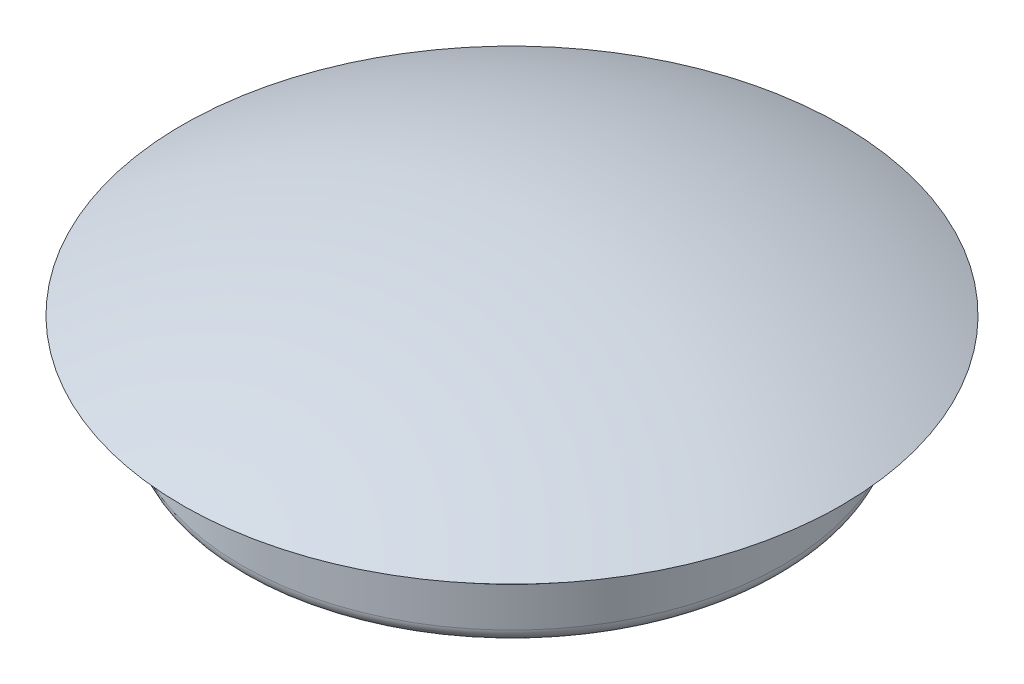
ISO-10303-21;
HEADER;
FILE_DESCRIPTION(('STEP AP214'),'2;1');
FILE_NAME('part.step','',(''),(''),'','','');
FILE_SCHEMA(('AUTOMOTIVE_DESIGN { 1 0 10303 214 1 1 1 1 }'));
ENDSEC;
DATA;
#1=APPLICATION_CONTEXT('core data for automotive mechanical design processes');
#2=APPLICATION_PROTOCOL_DEFINITION('international standard','automotive_design',2000,#1);
#3=PRODUCT_CONTEXT('',#1,'mechanical');
#4=PRODUCT('Part','Part','',(#3));
#5=PRODUCT_RELATED_PRODUCT_CATEGORY('part','',(#4));
#6=PRODUCT_DEFINITION_FORMATION('','',#4);
#7=PRODUCT_DEFINITION_CONTEXT('part definition',#1,'design');
#8=PRODUCT_DEFINITION('design','',#6,#7);
#9=PRODUCT_DEFINITION_SHAPE('','',#8);
#10=(LENGTH_UNIT() NAMED_UNIT(*) SI_UNIT(.MILLI.,.METRE.));
#11=(NAMED_UNIT(*) PLANE_ANGLE_UNIT() SI_UNIT($,.RADIAN.));
#12=(NAMED_UNIT(*) SI_UNIT($,.STERADIAN.) SOLID_ANGLE_UNIT());
#13=UNCERTAINTY_MEASURE_WITH_UNIT(LENGTH_MEASURE(1.E-05),#10,'distance_accuracy_value','');
#14=(GEOMETRIC_REPRESENTATION_CONTEXT(3) GLOBAL_UNCERTAINTY_ASSIGNED_CONTEXT((#13)) GLOBAL_UNIT_ASSIGNED_CONTEXT((#10,
#11,#12)) REPRESENTATION_CONTEXT('',''));
#15=CARTESIAN_POINT('',(0.,0.,0.));
#16=DIRECTION('',(0.,0.,1.));
#17=DIRECTION('',(1.,0.,0.));
#18=AXIS2_PLACEMENT_3D('',#15,#16,#17);
#19=CARTESIAN_POINT('',(6.5,4.,0.));
#20=DIRECTION('',(0.,-1.,0.));
#21=DIRECTION('',(0.,0.,-1.));
#22=AXIS2_PLACEMENT_3D('',#19,#20,#21);
#23=PLANE('',#22);
#24=CARTESIAN_POINT('',(0.,4.,0.));
#25=DIRECTION('',(0.,1.,0.));
#26=DIRECTION('',(0.,0.,1.));
#27=AXIS2_PLACEMENT_3D('',#24,#25,#26);
#28=CIRCLE('',#27,6.5);
#29=CARTESIAN_POINT('',(0.,4.,-6.5));
#30=VERTEX_POINT('',#29);
#31=CARTESIAN_POINT('',(0.,4.,6.5));
#32=VERTEX_POINT('',#31);
#33=EDGE_CURVE('E48',#30,#32,#28,.F.);
#34=ORIENTED_EDGE('',*,*,#33,.T.);
#35=CARTESIAN_POINT('',(0.,4.,0.));
#36=DIRECTION('',(0.,1.,0.));
#37=DIRECTION('',(0.,0.,-1.));
#38=AXIS2_PLACEMENT_3D('',#35,#36,#37);
#39=CIRCLE('',#38,6.5);
#40=EDGE_CURVE('E45',#32,#30,#39,.F.);
#41=ORIENTED_EDGE('',*,*,#40,.T.);
#42=EDGE_LOOP('',(#34,#41));
#43=FACE_BOUND('',#42,.T.);
#44=ADVANCED_FACE('F17',(#43),#23,.T.);
#45=CARTESIAN_POINT('',(0.,3.,0.));
#46=DIRECTION('',(0.,1.,0.));
#47=DIRECTION('',(0.,0.,1.));
#48=AXIS2_PLACEMENT_3D('',#45,#46,#47);
#49=TOROIDAL_SURFACE('',#48,6.5,1.);
#50=CARTESIAN_POINT('',(0.,3.,0.));
#51=DIRECTION('',(0.,1.,0.));
#52=DIRECTION('',(0.,0.,1.));
#53=AXIS2_PLACEMENT_3D('',#50,#51,#52);
#54=CIRCLE('',#53,7.5);
#55=CARTESIAN_POINT('',(0.,3.,7.5));
#56=VERTEX_POINT('',#55);
#57=EDGE_CURVE('E52',#56,#56,#54,.F.);
#58=ORIENTED_EDGE('',*,*,#57,.T.);
#59=EDGE_LOOP('',(#58));
#60=FACE_BOUND('',#59,.T.);
#61=ORIENTED_EDGE('',*,*,#40,.F.);
#62=ORIENTED_EDGE('',*,*,#33,.F.);
#63=EDGE_LOOP('',(#61,#62));
#64=FACE_BOUND('',#63,.T.);
#65=ADVANCED_FACE('F55',(#60,#64),#49,.F.);
#66=CARTESIAN_POINT('',(0.,7.39629683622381,0.));
#67=DIRECTION('',(0.,1.,0.));
#68=DIRECTION('',(0.,0.,1.));
#69=AXIS2_PLACEMENT_3D('',#66,#67,#68);
#70=CYLINDRICAL_SURFACE('',#69,7.5);
#71=CARTESIAN_POINT('',(0.,0.,0.));
#72=DIRECTION('',(0.,1.,0.));
#73=DIRECTION('',(0.,0.,1.));
#74=AXIS2_PLACEMENT_3D('',#71,#72,#73);
#75=CIRCLE('',#74,7.5);
#76=CARTESIAN_POINT('',(0.,0.,7.5));
#77=VERTEX_POINT('',#76);
#78=EDGE_CURVE('E114',#77,#77,#75,.F.);
#79=ORIENTED_EDGE('',*,*,#78,.T.);
#80=EDGE_LOOP('',(#79));
#81=FACE_BOUND('',#80,.T.);
#82=ORIENTED_EDGE('',*,*,#57,.F.);
#83=EDGE_LOOP('',(#82));
#84=FACE_BOUND('',#83,.T.);
#85=ADVANCED_FACE('F118',(#81,#84),#70,.F.);
#86=CARTESIAN_POINT('',(0.,0.,0.));
#87=DIRECTION('',(0.,1.,0.));
#88=DIRECTION('',(0.,0.,1.));
#89=AXIS2_PLACEMENT_3D('',#86,#87,#88);
#90=PLANE('',#89);
#91=ORIENTED_EDGE('',*,*,#78,.F.);
#92=EDGE_LOOP('',(#91));
#93=FACE_BOUND('',#92,.T.);
#94=CARTESIAN_POINT('',(0.,0.,0.));
#95=DIRECTION('',(0.,1.,0.));
#96=DIRECTION('',(0.,0.,1.));
#97=AXIS2_PLACEMENT_3D('',#94,#95,#96);
#98=CIRCLE('',#97,9.75);
#99=CARTESIAN_POINT('',(0.,0.,9.75));
#100=VERTEX_POINT('',#99);
#101=CARTESIAN_POINT('',(0.,0.,-9.75));
#102=VERTEX_POINT('',#101);
#103=EDGE_CURVE('E87',#100,#102,#98,.T.);
#104=ORIENTED_EDGE('',*,*,#103,.F.);
#105=CARTESIAN_POINT('',(0.,0.,0.));
#106=DIRECTION('',(0.,1.,0.));
#107=DIRECTION('',(0.,0.,-1.));
#108=AXIS2_PLACEMENT_3D('',#105,#106,#107);
#109=CIRCLE('',#108,9.75);
#110=EDGE_CURVE('E36',#102,#100,#109,.T.);
#111=ORIENTED_EDGE('',*,*,#110,.F.);
#112=EDGE_LOOP('',(#104,#111));
#113=FACE_BOUND('',#112,.T.);
#114=ADVANCED_FACE('F74',(#93,#113),#90,.F.);
#115=CARTESIAN_POINT('',(0.,0.5,0.));
#116=DIRECTION('',(0.,1.,0.));
#117=DIRECTION('',(0.,0.,1.));
#118=AXIS2_PLACEMENT_3D('',#115,#116,#117);
#119=TOROIDAL_SURFACE('',#118,9.75,0.5);
#120=CARTESIAN_POINT('',(0.,0.5,0.));
#121=DIRECTION('',(0.,1.,0.));
#122=DIRECTION('',(0.,0.,1.));
#123=AXIS2_PLACEMENT_3D('',#120,#121,#122);
#124=CIRCLE('',#123,10.25);
#125=CARTESIAN_POINT('',(0.,0.5,10.25));
#126=VERTEX_POINT('',#125);
#127=EDGE_CURVE('E84',#126,#126,#124,.T.);
#128=ORIENTED_EDGE('',*,*,#127,.F.);
#129=EDGE_LOOP('',(#128));
#130=FACE_BOUND('',#129,.T.);
#131=ORIENTED_EDGE('',*,*,#103,.T.);
#132=ORIENTED_EDGE('',*,*,#110,.T.);
#133=EDGE_LOOP('',(#131,#132));
#134=FACE_BOUND('',#133,.T.);
#135=ADVANCED_FACE('F62',(#130,#134),#119,.T.);
#136=CARTESIAN_POINT('',(0.,16.8559800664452,0.));
#137=DIRECTION('',(0.,1.,0.));
#138=DIRECTION('',(0.,0.,1.));
#139=AXIS2_PLACEMENT_3D('',#136,#137,#138);
#140=CYLINDRICAL_SURFACE('',#139,10.25);
#141=CARTESIAN_POINT('',(0.,2.,0.));
#142=DIRECTION('',(0.,1.,0.));
#143=DIRECTION('',(0.,0.,1.));
#144=AXIS2_PLACEMENT_3D('',#141,#142,#143);
#145=CIRCLE('',#144,10.25);
#146=CARTESIAN_POINT('',(0.,2.,10.25));
#147=VERTEX_POINT('',#146);
#148=EDGE_CURVE('E162',#147,#147,#145,.F.);
#149=ORIENTED_EDGE('',*,*,#148,.T.);
#150=EDGE_LOOP('',(#149));
#151=FACE_BOUND('',#150,.T.);
#152=ORIENTED_EDGE('',*,*,#127,.T.);
#153=EDGE_LOOP('',(#152));
#154=FACE_BOUND('',#153,.T.);
#155=ADVANCED_FACE('F73',(#151,#154),#140,.T.);
#156=CARTESIAN_POINT('',(10.25,2.,0.));
#157=DIRECTION('',(0.,-1.,0.));
#158=DIRECTION('',(0.,0.,-1.));
#159=AXIS2_PLACEMENT_3D('',#156,#157,#158);
#160=PLANE('',#159);
#161=ORIENTED_EDGE('',*,*,#148,.F.);
#162=EDGE_LOOP('',(#161));
#163=FACE_BOUND('',#162,.T.);
#164=CARTESIAN_POINT('',(0.,2.,0.));
#165=DIRECTION('',(0.,1.,0.));
#166=DIRECTION('',(0.,0.,1.));
#167=AXIS2_PLACEMENT_3D('',#164,#165,#166);
#168=CIRCLE('',#167,9.);
#169=CARTESIAN_POINT('',(0.,2.,9.));
#170=VERTEX_POINT('',#169);
#171=EDGE_CURVE('E160',#170,#170,#168,.T.);
#172=ORIENTED_EDGE('',*,*,#171,.F.);
#173=EDGE_LOOP('',(#172));
#174=FACE_BOUND('',#173,.T.);
#175=ADVANCED_FACE('F156',(#163,#174),#160,.F.);
#176=CARTESIAN_POINT('',(0.,16.8559800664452,0.));
#177=DIRECTION('',(0.,1.,0.));
#178=DIRECTION('',(0.,0.,1.));
#179=AXIS2_PLACEMENT_3D('',#176,#177,#178);
#180=CYLINDRICAL_SURFACE('',#179,9.);
#181=CARTESIAN_POINT('',(0.,3.6,0.));
#182=DIRECTION('',(0.,1.,0.));
#183=DIRECTION('',(0.,0.,1.));
#184=AXIS2_PLACEMENT_3D('',#181,#182,#183);
#185=CIRCLE('',#184,9.);
#186=CARTESIAN_POINT('',(0.,3.6,9.));
#187=VERTEX_POINT('',#186);
#188=EDGE_CURVE('E28',#187,#187,#185,.F.);
#189=ORIENTED_EDGE('',*,*,#188,.T.);
#190=EDGE_LOOP('',(#189));
#191=FACE_BOUND('',#190,.T.);
#192=ORIENTED_EDGE('',*,*,#171,.T.);
#193=EDGE_LOOP('',(#192));
#194=FACE_BOUND('',#193,.T.);
#195=ADVANCED_FACE('F149',(#191,#194),#180,.T.);
#196=CARTESIAN_POINT('',(9.,3.6,0.));
#197=DIRECTION('',(0.,1.,0.));
#198=DIRECTION('',(0.,0.,1.));
#199=AXIS2_PLACEMENT_3D('',#196,#197,#198);
#200=PLANE('',#199);
#201=ORIENTED_EDGE('',*,*,#188,.F.);
#202=EDGE_LOOP('',(#201));
#203=FACE_BOUND('',#202,.T.);
#204=CARTESIAN_POINT('',(12.5,3.6,0.));
#205=CARTESIAN_POINT('',(12.4999980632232,3.6,-0.350925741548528));
#206=CARTESIAN_POINT('',(12.4852097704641,3.6,-0.701915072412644));
#207=CARTESIAN_POINT('',(12.4261423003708,3.6,-1.40154352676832));
#208=CARTESIAN_POINT('',(12.3818485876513,3.6,-1.75018140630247));
#209=CARTESIAN_POINT('',(12.2639605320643,3.6,-2.44315774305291));
#210=CARTESIAN_POINT('',(12.1903107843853,3.6,-2.78748679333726));
#211=CARTESIAN_POINT('',(12.0142351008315,3.6,-3.46870681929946));
#212=CARTESIAN_POINT('',(11.9118089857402,3.60000000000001,-3.80559774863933));
#213=CARTESIAN_POINT('',(11.6790100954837,3.60000000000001,-4.46925905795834));
#214=CARTESIAN_POINT('',(11.5486612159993,3.6,-4.79603781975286));
#215=CARTESIAN_POINT('',(11.2608879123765,3.6,-5.43745955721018));
#216=CARTESIAN_POINT('',(11.1034626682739,3.6,-5.75210216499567));
#217=CARTESIAN_POINT('',(10.7627419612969,3.6,-6.36685385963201));
#218=CARTESIAN_POINT('',(10.5794590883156,3.6,-6.66696992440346));
#219=CARTESIAN_POINT('',(10.1882694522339,3.6,-7.25069695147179));
#220=CARTESIAN_POINT('',(9.98036287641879,3.6,-7.53430803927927));
#221=CARTESIAN_POINT('',(9.54135888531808,3.6,-8.08306624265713));
#222=CARTESIAN_POINT('',(9.310256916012,3.6,-8.34820971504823));
#223=CARTESIAN_POINT('',(8.82653862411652,3.6,-8.85808702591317));
#224=CARTESIAN_POINT('',(8.57392225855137,3.6,-9.10282082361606));
#225=CARTESIAN_POINT('',(8.04894889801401,3.6,-9.57015843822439));
#226=CARTESIAN_POINT('',(7.77659021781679,3.6,-9.792760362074));
#227=CARTESIAN_POINT('',(7.21408789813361,3.6,-10.2142276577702));
#228=CARTESIAN_POINT('',(6.92394426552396,3.59999999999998,-10.4130930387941));
#229=CARTESIAN_POINT('',(6.32794608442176,3.59999999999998,-10.7856664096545));
#230=CARTESIAN_POINT('',(6.02209212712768,3.6,-10.9593753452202));
#231=CARTESIAN_POINT('',(5.39683771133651,3.6,-11.2804097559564));
#232=CARTESIAN_POINT('',(5.07743725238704,3.6,-11.4277352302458));
#233=CARTESIAN_POINT('',(4.42736410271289,3.6,-11.6949538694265));
#234=CARTESIAN_POINT('',(4.09669153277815,3.6,-11.8148473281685));
#235=CARTESIAN_POINT('',(3.4264217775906,3.6,-12.0263515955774));
#236=CARTESIAN_POINT('',(3.08682459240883,3.60000000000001,-12.1179624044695));
#237=CARTESIAN_POINT('',(2.4011180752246,3.60000000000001,-12.2722504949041));
#238=CARTESIAN_POINT('',(2.05500870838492,3.6,-12.3349276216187));
#239=CARTESIAN_POINT('',(1.35874022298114,3.6,-12.4309020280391));
#240=CARTESIAN_POINT('',(1.00858110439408,3.6,-12.4641993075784));
#241=CARTESIAN_POINT('',(0.306702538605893,3.6,-12.5011772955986));
#242=CARTESIAN_POINT('',(-0.0450169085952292,3.6,-12.5048580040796));
#243=CARTESIAN_POINT('',(-0.747515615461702,3.6,-12.4825766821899));
#244=CARTESIAN_POINT('',(-1.09829487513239,3.6,-12.4566146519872));
#245=CARTESIAN_POINT('',(-1.79641750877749,3.6,-12.3752326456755));
#246=CARTESIAN_POINT('',(-2.14376090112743,3.6,-12.3198128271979));
#247=CARTESIAN_POINT('',(-2.8325443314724,3.6,-12.179909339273));
#248=CARTESIAN_POINT('',(-3.17398436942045,3.6,-12.0954256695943));
#249=CARTESIAN_POINT('',(-3.84853729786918,3.6,-11.8979940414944));
#250=CARTESIAN_POINT('',(-4.18165009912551,3.6,-11.7850457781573));
#251=CARTESIAN_POINT('',(-4.837176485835,3.6,-11.5314884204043));
#252=CARTESIAN_POINT('',(-5.15959007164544,3.60000000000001,-11.3908793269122));
#253=CARTESIAN_POINT('',(-5.79143774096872,3.60000000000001,-11.0829941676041));
#254=CARTESIAN_POINT('',(-6.10087133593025,3.6,-10.9157170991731));
#255=CARTESIAN_POINT('',(-6.70454619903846,3.6,-10.5556890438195));
#256=CARTESIAN_POINT('',(-6.99878746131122,3.6,-10.3629380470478));
#257=CARTESIAN_POINT('',(-7.56996103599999,3.6,-9.9533501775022));
#258=CARTESIAN_POINT('',(-7.84689482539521,3.6,-9.73651536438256));
#259=CARTESIAN_POINT('',(-8.38151165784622,3.6,-9.2802883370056));
#260=CARTESIAN_POINT('',(-8.63919473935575,3.6,-9.04089616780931));
#261=CARTESIAN_POINT('',(-9.13343029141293,3.6,-8.54130504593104));
#262=CARTESIAN_POINT('',(-9.3699869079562,3.6,-8.2811101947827));
#263=CARTESIAN_POINT('',(-9.82034721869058,3.6,-7.74171964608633));
#264=CARTESIAN_POINT('',(-10.0341507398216,3.6,-7.46252380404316));
#265=CARTESIAN_POINT('',(-10.4375814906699,3.6,-6.88697721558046));
#266=CARTESIAN_POINT('',(-10.6271969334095,3.6,-6.59061820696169));
#267=CARTESIAN_POINT('',(-10.9807757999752,3.6,-5.98298566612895));
#268=CARTESIAN_POINT('',(-11.1447400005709,3.60000000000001,-5.67171258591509));
#269=CARTESIAN_POINT('',(-11.4459856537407,3.60000000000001,-5.03618704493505));
#270=CARTESIAN_POINT('',(-11.583244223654,3.6,-4.71192373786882));
#271=CARTESIAN_POINT('',(-11.8299257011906,3.6,-4.05297638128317));
#272=CARTESIAN_POINT('',(-11.9393487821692,3.6,-3.71829239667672));
#273=CARTESIAN_POINT('',(-12.1294000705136,3.6,-3.04153963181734));
#274=CARTESIAN_POINT('',(-12.210082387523,3.6,-2.69948602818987));
#275=CARTESIAN_POINT('',(-12.3423377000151,3.6,-2.00993728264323));
#276=CARTESIAN_POINT('',(-12.3939250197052,3.6,-1.66244490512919));
#277=CARTESIAN_POINT('',(-12.4538490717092,3.6,-1.09534467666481));
#278=CARTESIAN_POINT('',(-12.4711502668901,3.6,-0.876645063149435));
#279=CARTESIAN_POINT('',(-12.4942263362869,3.6,-0.438638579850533));
#280=CARTESIAN_POINT('',(-12.5000012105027,3.6,-0.219331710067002));
#281=CARTESIAN_POINT('',(-12.4999980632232,3.6,0.350925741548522));
#282=CARTESIAN_POINT('',(-12.4852097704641,3.6,0.701915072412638));
#283=CARTESIAN_POINT('',(-12.4261423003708,3.6,1.40154352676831));
#284=CARTESIAN_POINT('',(-12.3818485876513,3.6,1.75018140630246));
#285=CARTESIAN_POINT('',(-12.2639605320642,3.6,2.44315774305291));
#286=CARTESIAN_POINT('',(-12.1903107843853,3.6,2.78748679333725));
#287=CARTESIAN_POINT('',(-12.0142351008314,3.6,3.46870681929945));
#288=CARTESIAN_POINT('',(-11.9118089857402,3.60000000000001,3.80559774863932));
#289=CARTESIAN_POINT('',(-11.6790100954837,3.60000000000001,4.46925905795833));
#290=CARTESIAN_POINT('',(-11.5486612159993,3.6,4.79603781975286));
#291=CARTESIAN_POINT('',(-11.2608879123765,3.6,5.43745955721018));
#292=CARTESIAN_POINT('',(-11.1034626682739,3.6,5.75210216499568));
#293=CARTESIAN_POINT('',(-10.7627419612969,3.6,6.36685385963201));
#294=CARTESIAN_POINT('',(-10.5794590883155,3.6,6.66696992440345));
#295=CARTESIAN_POINT('',(-10.1882694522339,3.6,7.2506969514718));
#296=CARTESIAN_POINT('',(-9.98036287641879,3.6,7.53430803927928));
#297=CARTESIAN_POINT('',(-9.54135888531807,3.6,8.08306624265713));
#298=CARTESIAN_POINT('',(-9.31025691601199,3.6,8.34820971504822));
#299=CARTESIAN_POINT('',(-8.8265386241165,3.6,8.85808702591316));
#300=CARTESIAN_POINT('',(-8.57392225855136,3.6,9.10282082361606));
#301=CARTESIAN_POINT('',(-8.04894889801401,3.6,9.57015843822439));
#302=CARTESIAN_POINT('',(-7.77659021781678,3.6,9.792760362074));
#303=CARTESIAN_POINT('',(-7.21408789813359,3.6,10.2142276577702));
#304=CARTESIAN_POINT('',(-6.92394426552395,3.6,10.4130930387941));
#305=CARTESIAN_POINT('',(-6.32794608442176,3.6,10.7856664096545));
#306=CARTESIAN_POINT('',(-6.02209212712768,3.6,10.9593753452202));
#307=CARTESIAN_POINT('',(-5.39683771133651,3.6,11.2804097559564));
#308=CARTESIAN_POINT('',(-5.07743725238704,3.6,11.4277352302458));
#309=CARTESIAN_POINT('',(-4.42736410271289,3.6,11.6949538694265));
#310=CARTESIAN_POINT('',(-4.09669153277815,3.6,11.8148473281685));
#311=CARTESIAN_POINT('',(-3.4264217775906,3.6,12.0263515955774));
#312=CARTESIAN_POINT('',(-3.08682459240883,3.6,12.1179624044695));
#313=CARTESIAN_POINT('',(-2.4011180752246,3.6,12.2722504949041));
#314=CARTESIAN_POINT('',(-2.05500870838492,3.6,12.3349276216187));
#315=CARTESIAN_POINT('',(-1.35874022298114,3.6,12.4309020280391));
#316=CARTESIAN_POINT('',(-1.00858110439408,3.6,12.4641993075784));
#317=CARTESIAN_POINT('',(-0.306702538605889,3.6,12.5011772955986));
#318=CARTESIAN_POINT('',(0.0450169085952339,3.6,12.5048580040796));
#319=CARTESIAN_POINT('',(0.747515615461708,3.6,12.4825766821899));
#320=CARTESIAN_POINT('',(1.09829487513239,3.6,12.4566146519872));
#321=CARTESIAN_POINT('',(1.7964175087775,3.6,12.3752326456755));
#322=CARTESIAN_POINT('',(2.14376090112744,3.6,12.319812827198));
#323=CARTESIAN_POINT('',(2.83254433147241,3.6,12.179909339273));
#324=CARTESIAN_POINT('',(3.17398436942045,3.6,12.0954256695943));
#325=CARTESIAN_POINT('',(3.84853729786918,3.6,11.8979940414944));
#326=CARTESIAN_POINT('',(4.18165009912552,3.6,11.7850457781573));
#327=CARTESIAN_POINT('',(4.83717648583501,3.6,11.5314884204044));
#328=CARTESIAN_POINT('',(5.15959007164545,3.60000000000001,11.3908793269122));
#329=CARTESIAN_POINT('',(5.79143774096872,3.60000000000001,11.0829941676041));
#330=CARTESIAN_POINT('',(6.10087133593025,3.6,10.9157170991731));
#331=CARTESIAN_POINT('',(6.70454619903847,3.6,10.5556890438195));
#332=CARTESIAN_POINT('',(6.99878746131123,3.6,10.3629380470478));
#333=CARTESIAN_POINT('',(7.569961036,3.6,9.9533501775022));
#334=CARTESIAN_POINT('',(7.84689482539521,3.6,9.73651536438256));
#335=CARTESIAN_POINT('',(8.38151165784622,3.6,9.2802883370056));
#336=CARTESIAN_POINT('',(8.63919473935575,3.60000000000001,9.0408961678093));
#337=CARTESIAN_POINT('',(9.13343029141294,3.60000000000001,8.54130504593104));
#338=CARTESIAN_POINT('',(9.36998690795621,3.6,8.2811101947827));
#339=CARTESIAN_POINT('',(9.82034721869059,3.6,7.74171964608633));
#340=CARTESIAN_POINT('',(10.0341507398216,3.6,7.46252380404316));
#341=CARTESIAN_POINT('',(10.4375814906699,3.6,6.88697721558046));
#342=CARTESIAN_POINT('',(10.6271969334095,3.59999999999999,6.59061820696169));
#343=CARTESIAN_POINT('',(10.9807757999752,3.60000000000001,5.98298566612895));
#344=CARTESIAN_POINT('',(11.1447400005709,3.60000000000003,5.67171258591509));
#345=CARTESIAN_POINT('',(11.4459856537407,3.60000000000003,5.03618704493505));
#346=CARTESIAN_POINT('',(11.583244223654,3.60000000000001,4.71192373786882));
#347=CARTESIAN_POINT('',(11.8299257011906,3.59999999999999,4.05297638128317));
#348=CARTESIAN_POINT('',(11.9393487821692,3.6,3.71829239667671));
#349=CARTESIAN_POINT('',(12.1294000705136,3.6,3.04153963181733));
#350=CARTESIAN_POINT('',(12.210082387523,3.6,2.69948602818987));
#351=CARTESIAN_POINT('',(12.3423377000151,3.6,2.00993728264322));
#352=CARTESIAN_POINT('',(12.3939250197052,3.6,1.66244490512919));
#353=CARTESIAN_POINT('',(12.4538490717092,3.6,1.0953446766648));
#354=CARTESIAN_POINT('',(12.4711502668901,3.6,0.876645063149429));
#355=CARTESIAN_POINT('',(12.4942263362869,3.6,0.438638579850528));
#356=CARTESIAN_POINT('',(12.5000012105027,3.6,0.219331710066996));
#357=CARTESIAN_POINT('',(12.5,3.6,0.));
#358=B_SPLINE_CURVE_WITH_KNOTS('',3,(#204,#205,#206,#207,#208,#209,#210,#211,#212,#213,#214,
#215,#216,#217,#218,#219,#220,#221,#222,#223,#224,#225,#226,#227,#228,#229,#230,#231,#232,#233,
#234,#235,#236,#237,#238,#239,#240,#241,#242,#243,#244,#245,#246,#247,#248,#249,#250,#251,#252,
#253,#254,#255,#256,#257,#258,#259,#260,#261,#262,#263,#264,#265,#266,#267,#268,#269,#270,#271,
#272,#273,#274,#275,#276,#277,#278,#279,#280,#281,#282,#283,#284,#285,#286,#287,#288,#289,#290,
#291,#292,#293,#294,#295,#296,#297,#298,#299,#300,#301,#302,#303,#304,#305,#306,#307,#308,#309,
#310,#311,#312,#313,#314,#315,#316,#317,#318,#319,#320,#321,#322,#323,#324,#325,#326,#327,#328,
#329,#330,#331,#332,#333,#334,#335,#336,#337,#338,#339,#340,#341,#342,#343,#344,#345,#346,#347,
#348,#349,#350,#351,#352,#353,#354,#355,#356,#357),.UNSPECIFIED.,.T.,.F.,(4,2,2,2,2,2,2,2,2,2,2,
2,2,2,2,2,2,2,2,2,2,2,2,2,2,2,2,2,2,2,2,2,2,2,2,2,2,2,2,2,2,2,2,2,2,2,2,2,2,2,2,2,2,2,2,2,2,2,2,
2,2,2,2,2,2,2,2,2,2,2,2,2,2,2,2,2,4),(0.,1.05257643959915,2.10567179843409,3.16076418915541,
4.21586315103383,5.27006276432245,6.32429430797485,7.37801431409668,8.43172630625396,
9.48564558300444,10.5395669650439,11.5935784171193,12.6475894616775,13.7015608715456,
14.7555323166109,15.8094924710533,16.8634526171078,17.9174184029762,18.971384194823,
20.0253499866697,21.0793157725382,22.1332759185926,23.187236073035,24.2412075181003,
25.2951789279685,26.3491899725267,27.4032014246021,28.4571228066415,29.511042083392,
30.5647540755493,31.6184740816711,32.6727056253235,33.7269052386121,34.7820042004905,
35.8370965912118,36.8901919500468,37.9427683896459,38.6006380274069,39.2585076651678,
40.311084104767,41.3641794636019,42.4192718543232,43.4743708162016,44.5285704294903,
45.5828019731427,46.6365219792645,47.6902339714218,48.7441532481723,49.7980746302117,
50.8520860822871,51.9060971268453,52.9600685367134,54.0140399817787,55.0680001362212,
56.1219602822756,57.1759260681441,58.2298918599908,59.2838576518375,60.337823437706,
61.3917835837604,62.4457437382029,63.4997151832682,64.5536865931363,65.6076976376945,
66.6617090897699,67.7156304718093,68.7695497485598,69.8232617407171,70.8769817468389,
71.9312132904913,72.9854129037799,74.0405118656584,75.0956042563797,76.1486996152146,
77.2012760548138,77.8591456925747,78.5170153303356),.UNSPECIFIED.);
#359=CARTESIAN_POINT('',(12.5,3.6,0.));
#360=VERTEX_POINT('',#359);
#361=EDGE_CURVE('E11',#360,#360,#358,.T.);
#362=ORIENTED_EDGE('',*,*,#361,.F.);
#363=EDGE_LOOP('',(#362));
#364=FACE_BOUND('',#363,.T.);
#365=ADVANCED_FACE('F137',(#203,#364),#200,.F.);
#366=CARTESIAN_POINT('',(0.,-21.8896551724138,0.));
#367=DIRECTION('',(1.,0.,0.));
#368=DIRECTION('',(0.,-1.,0.));
#369=AXIS2_PLACEMENT_3D('',#366,#367,#368);
#370=SPHERICAL_SURFACE('',#369,28.3896551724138);
#371=ORIENTED_EDGE('',*,*,#361,.T.);
#372=EDGE_LOOP('',(#371));
#373=FACE_BOUND('',#372,.T.);
#374=ADVANCED_FACE('F140',(#373),#370,.T.);
#375=CLOSED_SHELL('',(#44,#65,#85,#114,#135,#155,#175,#195,#365,#374));
#376=MANIFOLD_SOLID_BREP('B1',#375);
#377=ADVANCED_BREP_SHAPE_REPRESENTATION('',(#18,#376),#14);
#378=SHAPE_DEFINITION_REPRESENTATION(#9,#377);
ENDSEC;
END-ISO-10303-21;
